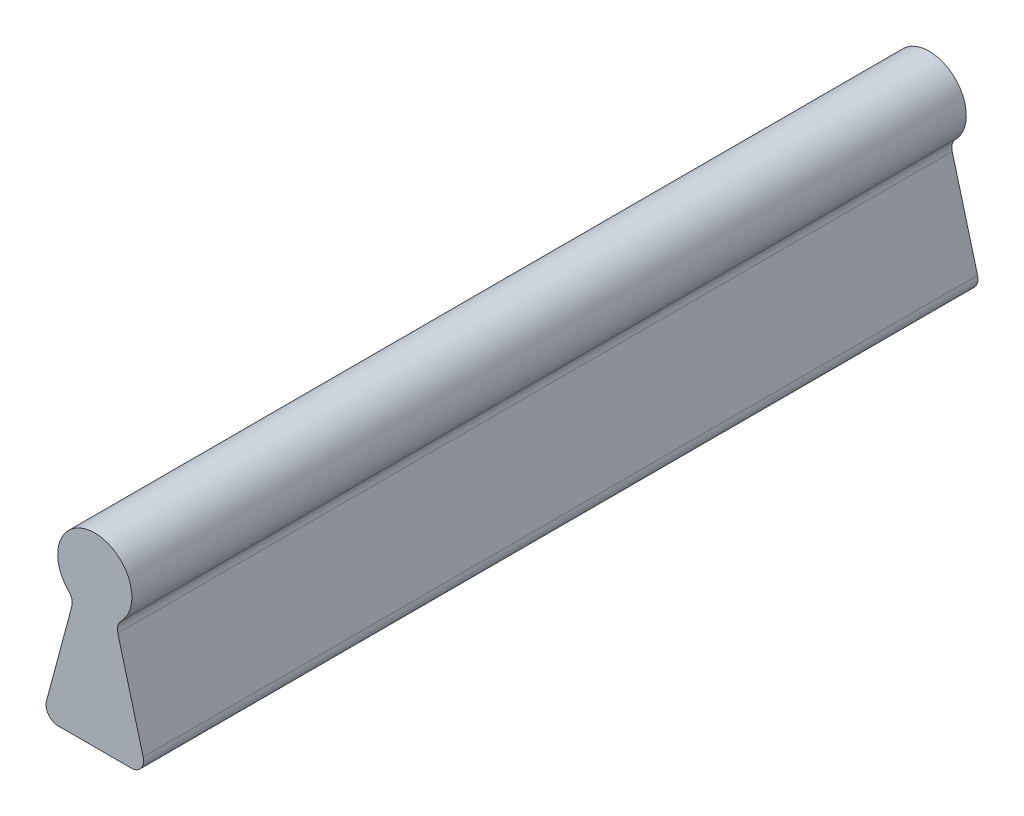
ISO-10303-21;
HEADER;
FILE_DESCRIPTION(('STEP AP214'),'2;1');
FILE_NAME('part.step','',(''),(''),'','','');
FILE_SCHEMA(('AUTOMOTIVE_DESIGN { 1 0 10303 214 1 1 1 1 }'));
ENDSEC;
DATA;
#1=APPLICATION_CONTEXT('core data for automotive mechanical design processes');
#2=APPLICATION_PROTOCOL_DEFINITION('international standard','automotive_design',2000,#1);
#3=PRODUCT_CONTEXT('',#1,'mechanical');
#4=PRODUCT('Part','Part','',(#3));
#5=PRODUCT_RELATED_PRODUCT_CATEGORY('part','',(#4));
#6=PRODUCT_DEFINITION_FORMATION('','',#4);
#7=PRODUCT_DEFINITION_CONTEXT('part definition',#1,'design');
#8=PRODUCT_DEFINITION('design','',#6,#7);
#9=PRODUCT_DEFINITION_SHAPE('','',#8);
#10=(LENGTH_UNIT() NAMED_UNIT(*) SI_UNIT(.MILLI.,.METRE.));
#11=(NAMED_UNIT(*) PLANE_ANGLE_UNIT() SI_UNIT($,.RADIAN.));
#12=(NAMED_UNIT(*) SI_UNIT($,.STERADIAN.) SOLID_ANGLE_UNIT());
#13=UNCERTAINTY_MEASURE_WITH_UNIT(LENGTH_MEASURE(1.E-05),#10,'distance_accuracy_value','');
#14=(GEOMETRIC_REPRESENTATION_CONTEXT(3) GLOBAL_UNCERTAINTY_ASSIGNED_CONTEXT((#13)) GLOBAL_UNIT_ASSIGNED_CONTEXT((#10,
#11,#12)) REPRESENTATION_CONTEXT('',''));
#15=CARTESIAN_POINT('',(0.,0.,0.));
#16=DIRECTION('',(0.,0.,1.));
#17=DIRECTION('',(1.,0.,0.));
#18=AXIS2_PLACEMENT_3D('',#15,#16,#17);
#19=CARTESIAN_POINT('',(24.4474411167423,-6.,84.4507865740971));
#20=DIRECTION('',(0.,0.,-1.));
#21=DIRECTION('',(-1.,0.,0.));
#22=AXIS2_PLACEMENT_3D('',#19,#20,#21);
#23=CYLINDRICAL_SURFACE('',#22,1.);
#24=CARTESIAN_POINT('',(24.4474411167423,-6.,67.5));
#25=DIRECTION('',(0.,0.,1.));
#26=DIRECTION('',(0.,-1.,0.));
#27=AXIS2_PLACEMENT_3D('',#24,#25,#26);
#28=CIRCLE('',#27,1.);
#29=CARTESIAN_POINT('',(24.4474411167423,-7.,67.5));
#30=VERTEX_POINT('',#29);
#31=CARTESIAN_POINT('',(25.4133669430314,-5.74118095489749,67.5));
#32=VERTEX_POINT('',#31);
#33=EDGE_CURVE('E131',#30,#32,#28,.T.);
#34=ORIENTED_EDGE('',*,*,#33,.F.);
#35=DIRECTION('',(0.,0.,-1.));
#36=VECTOR('',#35,1.);
#37=CARTESIAN_POINT('',(24.4474411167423,-7.,84.4507865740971));
#38=LINE('',#37,#36);
#39=CARTESIAN_POINT('',(24.4474411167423,-7.,0.));
#40=VERTEX_POINT('',#39);
#41=EDGE_CURVE('E36',#30,#40,#38,.T.);
#42=ORIENTED_EDGE('',*,*,#41,.T.);
#43=CARTESIAN_POINT('',(24.4474411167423,-6.,0.));
#44=DIRECTION('',(0.,0.,1.));
#45=DIRECTION('',(1.,0.,0.));
#46=AXIS2_PLACEMENT_3D('',#43,#44,#45);
#47=CIRCLE('',#46,1.);
#48=CARTESIAN_POINT('',(25.4133669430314,-5.74118095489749,0.));
#49=VERTEX_POINT('',#48);
#50=EDGE_CURVE('E139',#40,#49,#47,.T.);
#51=ORIENTED_EDGE('',*,*,#50,.T.);
#52=DIRECTION('',(0.,0.,-1.));
#53=VECTOR('',#52,1.);
#54=CARTESIAN_POINT('',(25.4133669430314,-5.74118095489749,84.4507865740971));
#55=LINE('',#54,#53);
#56=EDGE_CURVE('E87',#32,#49,#55,.T.);
#57=ORIENTED_EDGE('',*,*,#56,.F.);
#58=EDGE_LOOP('',(#34,#42,#51,#57));
#59=FACE_BOUND('',#58,.T.);
#60=ADVANCED_FACE('F32',(#59),#23,.T.);
#61=CARTESIAN_POINT('',(25.4133669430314,-5.74118095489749,84.4507865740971));
#62=DIRECTION('',(-0.96592582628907,-0.258819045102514,0.));
#63=DIRECTION('',(0.258819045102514,-0.96592582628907,0.));
#64=AXIS2_PLACEMENT_3D('',#61,#62,#63);
#65=PLANE('',#64);
#66=DIRECTION('',(-0.258819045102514,0.96592582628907,0.));
#67=VECTOR('',#66,1.);
#68=CARTESIAN_POINT('',(25.4133669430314,-5.74118095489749,67.5));
#69=LINE('',#68,#67);
#70=CARTESIAN_POINT('',(23.3625012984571,1.9127538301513,67.5));
#71=VERTEX_POINT('',#70);
#72=EDGE_CURVE('E94',#32,#71,#69,.T.);
#73=ORIENTED_EDGE('',*,*,#72,.F.);
#74=ORIENTED_EDGE('',*,*,#56,.T.);
#75=DIRECTION('',(-0.258819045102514,0.96592582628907,0.));
#76=VECTOR('',#75,1.);
#77=CARTESIAN_POINT('',(25.4133669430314,-5.74118095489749,0.));
#78=LINE('',#77,#76);
#79=CARTESIAN_POINT('',(23.3625012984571,1.9127538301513,0.));
#80=VERTEX_POINT('',#79);
#81=EDGE_CURVE('E138',#49,#80,#78,.T.);
#82=ORIENTED_EDGE('',*,*,#81,.T.);
#83=DIRECTION('',(0.,0.,-1.));
#84=VECTOR('',#83,1.);
#85=CARTESIAN_POINT('',(23.3625012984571,1.9127538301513,84.4507865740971));
#86=LINE('',#85,#84);
#87=EDGE_CURVE('E140',#71,#80,#86,.T.);
#88=ORIENTED_EDGE('',*,*,#87,.F.);
#89=EDGE_LOOP('',(#73,#74,#82,#88));
#90=FACE_BOUND('',#89,.T.);
#91=ADVANCED_FACE('F169',(#90),#65,.F.);
#92=CARTESIAN_POINT('',(24.3284271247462,2.17157287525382,84.4507865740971));
#93=DIRECTION('',(0.,0.,-1.));
#94=DIRECTION('',(-1.,0.,0.));
#95=AXIS2_PLACEMENT_3D('',#92,#93,#94);
#96=CYLINDRICAL_SURFACE('',#95,1.);
#97=CARTESIAN_POINT('',(24.3284271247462,2.17157287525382,67.5));
#98=DIRECTION('',(0.,0.,1.));
#99=DIRECTION('',(0.,-1.,0.));
#100=AXIS2_PLACEMENT_3D('',#97,#98,#99);
#101=CIRCLE('',#100,1.);
#102=CARTESIAN_POINT('',(23.6213203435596,2.87867965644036,67.5));
#103=VERTEX_POINT('',#102);
#104=EDGE_CURVE('E127',#71,#103,#101,.F.);
#105=ORIENTED_EDGE('',*,*,#104,.F.);
#106=ORIENTED_EDGE('',*,*,#87,.T.);
#107=CARTESIAN_POINT('',(24.3284271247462,2.17157287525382,0.));
#108=DIRECTION('',(0.,0.,-1.));
#109=DIRECTION('',(1.,0.,0.));
#110=AXIS2_PLACEMENT_3D('',#107,#108,#109);
#111=CIRCLE('',#110,1.);
#112=CARTESIAN_POINT('',(23.6213203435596,2.87867965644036,0.));
#113=VERTEX_POINT('',#112);
#114=EDGE_CURVE('E142',#80,#113,#111,.T.);
#115=ORIENTED_EDGE('',*,*,#114,.T.);
#116=DIRECTION('',(0.,0.,-1.));
#117=VECTOR('',#116,1.);
#118=CARTESIAN_POINT('',(23.6213203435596,2.87867965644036,84.4507865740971));
#119=LINE('',#118,#117);
#120=EDGE_CURVE('E143',#103,#113,#119,.T.);
#121=ORIENTED_EDGE('',*,*,#120,.F.);
#122=EDGE_LOOP('',(#105,#106,#115,#121));
#123=FACE_BOUND('',#122,.T.);
#124=ADVANCED_FACE('F172',(#123),#96,.F.);
#125=CARTESIAN_POINT('',(21.5,5.,84.4507865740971));
#126=DIRECTION('',(0.,0.,-1.));
#127=DIRECTION('',(-1.,0.,0.));
#128=AXIS2_PLACEMENT_3D('',#125,#126,#127);
#129=CYLINDRICAL_SURFACE('',#128,3.);
#130=CARTESIAN_POINT('',(21.5,5.,67.5));
#131=DIRECTION('',(0.,0.,1.));
#132=DIRECTION('',(0.,-1.,0.));
#133=AXIS2_PLACEMENT_3D('',#130,#131,#132);
#134=CIRCLE('',#133,3.);
#135=CARTESIAN_POINT('',(19.3786796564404,2.87867965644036,67.5));
#136=VERTEX_POINT('',#135);
#137=EDGE_CURVE('E122',#103,#136,#134,.T.);
#138=ORIENTED_EDGE('',*,*,#137,.F.);
#139=ORIENTED_EDGE('',*,*,#120,.T.);
#140=CARTESIAN_POINT('',(21.5,5.,0.));
#141=DIRECTION('',(0.,0.,1.));
#142=DIRECTION('',(1.,0.,0.));
#143=AXIS2_PLACEMENT_3D('',#140,#141,#142);
#144=CIRCLE('',#143,3.);
#145=CARTESIAN_POINT('',(19.3786796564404,2.87867965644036,0.));
#146=VERTEX_POINT('',#145);
#147=EDGE_CURVE('E145',#113,#146,#144,.T.);
#148=ORIENTED_EDGE('',*,*,#147,.T.);
#149=DIRECTION('',(0.,0.,-1.));
#150=VECTOR('',#149,1.);
#151=CARTESIAN_POINT('',(19.3786796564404,2.87867965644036,84.4507865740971));
#152=LINE('',#151,#150);
#153=EDGE_CURVE('E146',#136,#146,#152,.T.);
#154=ORIENTED_EDGE('',*,*,#153,.F.);
#155=EDGE_LOOP('',(#138,#139,#148,#154));
#156=FACE_BOUND('',#155,.T.);
#157=ADVANCED_FACE('F174',(#156),#129,.T.);
#158=CARTESIAN_POINT('',(18.6715728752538,2.17157287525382,84.4507865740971));
#159=DIRECTION('',(0.,0.,-1.));
#160=DIRECTION('',(-1.,0.,0.));
#161=AXIS2_PLACEMENT_3D('',#158,#159,#160);
#162=CYLINDRICAL_SURFACE('',#161,1.);
#163=CARTESIAN_POINT('',(18.6715728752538,2.17157287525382,67.5));
#164=DIRECTION('',(0.,0.,1.));
#165=DIRECTION('',(0.,-1.,0.));
#166=AXIS2_PLACEMENT_3D('',#163,#164,#165);
#167=CIRCLE('',#166,1.);
#168=CARTESIAN_POINT('',(19.6374987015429,1.9127538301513,67.5));
#169=VERTEX_POINT('',#168);
#170=EDGE_CURVE('E120',#136,#169,#167,.F.);
#171=ORIENTED_EDGE('',*,*,#170,.F.);
#172=ORIENTED_EDGE('',*,*,#153,.T.);
#173=CARTESIAN_POINT('',(18.6715728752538,2.17157287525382,0.));
#174=DIRECTION('',(0.,0.,-1.));
#175=DIRECTION('',(1.,0.,0.));
#176=AXIS2_PLACEMENT_3D('',#173,#174,#175);
#177=CIRCLE('',#176,1.);
#178=CARTESIAN_POINT('',(19.6374987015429,1.9127538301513,0.));
#179=VERTEX_POINT('',#178);
#180=EDGE_CURVE('E148',#146,#179,#177,.T.);
#181=ORIENTED_EDGE('',*,*,#180,.T.);
#182=DIRECTION('',(0.,0.,-1.));
#183=VECTOR('',#182,1.);
#184=CARTESIAN_POINT('',(19.6374987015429,1.9127538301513,84.4507865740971));
#185=LINE('',#184,#183);
#186=EDGE_CURVE('E149',#169,#179,#185,.T.);
#187=ORIENTED_EDGE('',*,*,#186,.F.);
#188=EDGE_LOOP('',(#171,#172,#181,#187));
#189=FACE_BOUND('',#188,.T.);
#190=ADVANCED_FACE('F178',(#189),#162,.F.);
#191=CARTESIAN_POINT('',(19.6374987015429,1.9127538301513,84.4507865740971));
#192=DIRECTION('',(0.96592582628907,-0.258819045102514,0.));
#193=DIRECTION('',(0.258819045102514,0.96592582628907,0.));
#194=AXIS2_PLACEMENT_3D('',#191,#192,#193);
#195=PLANE('',#194);
#196=DIRECTION('',(-0.258819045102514,-0.96592582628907,0.));
#197=VECTOR('',#196,1.);
#198=CARTESIAN_POINT('',(19.6374987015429,1.9127538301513,67.5));
#199=LINE('',#198,#197);
#200=CARTESIAN_POINT('',(17.5866330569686,-5.74118095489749,67.5));
#201=VERTEX_POINT('',#200);
#202=EDGE_CURVE('E41',#169,#201,#199,.T.);
#203=ORIENTED_EDGE('',*,*,#202,.F.);
#204=ORIENTED_EDGE('',*,*,#186,.T.);
#205=DIRECTION('',(-0.258819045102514,-0.96592582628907,0.));
#206=VECTOR('',#205,1.);
#207=CARTESIAN_POINT('',(19.6374987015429,1.9127538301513,0.));
#208=LINE('',#207,#206);
#209=CARTESIAN_POINT('',(17.5866330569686,-5.74118095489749,0.));
#210=VERTEX_POINT('',#209);
#211=EDGE_CURVE('E114',#179,#210,#208,.T.);
#212=ORIENTED_EDGE('',*,*,#211,.T.);
#213=DIRECTION('',(0.,0.,-1.));
#214=VECTOR('',#213,1.);
#215=CARTESIAN_POINT('',(17.5866330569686,-5.74118095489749,84.4507865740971));
#216=LINE('',#215,#214);
#217=EDGE_CURVE('E105',#201,#210,#216,.T.);
#218=ORIENTED_EDGE('',*,*,#217,.F.);
#219=EDGE_LOOP('',(#203,#204,#212,#218));
#220=FACE_BOUND('',#219,.T.);
#221=ADVANCED_FACE('F111',(#220),#195,.F.);
#222=CARTESIAN_POINT('',(18.5525588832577,-6.,84.4507865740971));
#223=DIRECTION('',(0.,0.,-1.));
#224=DIRECTION('',(-1.,0.,0.));
#225=AXIS2_PLACEMENT_3D('',#222,#223,#224);
#226=CYLINDRICAL_SURFACE('',#225,1.);
#227=CARTESIAN_POINT('',(18.5525588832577,-6.,67.5));
#228=DIRECTION('',(0.,0.,1.));
#229=DIRECTION('',(0.,-1.,0.));
#230=AXIS2_PLACEMENT_3D('',#227,#228,#229);
#231=CIRCLE('',#230,1.);
#232=CARTESIAN_POINT('',(18.5525588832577,-7.,67.5));
#233=VERTEX_POINT('',#232);
#234=EDGE_CURVE('E11',#201,#233,#231,.T.);
#235=ORIENTED_EDGE('',*,*,#234,.F.);
#236=ORIENTED_EDGE('',*,*,#217,.T.);
#237=CARTESIAN_POINT('',(18.5525588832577,-6.,0.));
#238=DIRECTION('',(0.,0.,1.));
#239=DIRECTION('',(1.,0.,0.));
#240=AXIS2_PLACEMENT_3D('',#237,#238,#239);
#241=CIRCLE('',#240,1.);
#242=CARTESIAN_POINT('',(18.5525588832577,-7.,0.));
#243=VERTEX_POINT('',#242);
#244=EDGE_CURVE('E116',#210,#243,#241,.T.);
#245=ORIENTED_EDGE('',*,*,#244,.T.);
#246=DIRECTION('',(0.,0.,-1.));
#247=VECTOR('',#246,1.);
#248=CARTESIAN_POINT('',(18.5525588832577,-7.,84.4507865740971));
#249=LINE('',#248,#247);
#250=EDGE_CURVE('E54',#233,#243,#249,.T.);
#251=ORIENTED_EDGE('',*,*,#250,.F.);
#252=EDGE_LOOP('',(#235,#236,#245,#251));
#253=FACE_BOUND('',#252,.T.);
#254=ADVANCED_FACE('F104',(#253),#226,.T.);
#255=CARTESIAN_POINT('',(18.5525588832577,-7.,84.4507865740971));
#256=DIRECTION('',(0.,1.,0.));
#257=DIRECTION('',(-1.,0.,0.));
#258=AXIS2_PLACEMENT_3D('',#255,#256,#257);
#259=PLANE('',#258);
#260=DIRECTION('',(1.,0.,0.));
#261=VECTOR('',#260,1.);
#262=CARTESIAN_POINT('',(18.5525588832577,-7.,67.5));
#263=LINE('',#262,#261);
#264=EDGE_CURVE('E134',#233,#30,#263,.T.);
#265=ORIENTED_EDGE('',*,*,#264,.F.);
#266=ORIENTED_EDGE('',*,*,#250,.T.);
#267=DIRECTION('',(1.,0.,0.));
#268=VECTOR('',#267,1.);
#269=CARTESIAN_POINT('',(18.5525588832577,-7.,0.));
#270=LINE('',#269,#268);
#271=EDGE_CURVE('E136',#243,#40,#270,.T.);
#272=ORIENTED_EDGE('',*,*,#271,.T.);
#273=ORIENTED_EDGE('',*,*,#41,.F.);
#274=EDGE_LOOP('',(#265,#266,#272,#273));
#275=FACE_BOUND('',#274,.T.);
#276=ADVANCED_FACE('F164',(#275),#259,.F.);
#277=CARTESIAN_POINT('',(24.4474411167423,-6.,0.));
#278=DIRECTION('',(0.,0.,1.));
#279=DIRECTION('',(1.,0.,0.));
#280=AXIS2_PLACEMENT_3D('',#277,#278,#279);
#281=PLANE('',#280);
#282=ORIENTED_EDGE('',*,*,#50,.F.);
#283=ORIENTED_EDGE('',*,*,#271,.F.);
#284=ORIENTED_EDGE('',*,*,#244,.F.);
#285=ORIENTED_EDGE('',*,*,#211,.F.);
#286=ORIENTED_EDGE('',*,*,#180,.F.);
#287=ORIENTED_EDGE('',*,*,#147,.F.);
#288=ORIENTED_EDGE('',*,*,#114,.F.);
#289=ORIENTED_EDGE('',*,*,#81,.F.);
#290=EDGE_LOOP('',(#282,#283,#284,#285,#286,#287,#288,#289));
#291=FACE_BOUND('',#290,.T.);
#292=ADVANCED_FACE('F166',(#291),#281,.F.);
#293=CARTESIAN_POINT('',(25.2999999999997,-0.0499999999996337,67.5));
#294=DIRECTION('',(0.,0.,1.));
#295=DIRECTION('',(0.,-1.,0.));
#296=AXIS2_PLACEMENT_3D('',#293,#294,#295);
#297=PLANE('',#296);
#298=ORIENTED_EDGE('',*,*,#264,.T.);
#299=ORIENTED_EDGE('',*,*,#33,.T.);
#300=ORIENTED_EDGE('',*,*,#72,.T.);
#301=ORIENTED_EDGE('',*,*,#104,.T.);
#302=ORIENTED_EDGE('',*,*,#137,.T.);
#303=ORIENTED_EDGE('',*,*,#170,.T.);
#304=ORIENTED_EDGE('',*,*,#202,.T.);
#305=ORIENTED_EDGE('',*,*,#234,.T.);
#306=EDGE_LOOP('',(#298,#299,#300,#301,#302,#303,#304,#305));
#307=FACE_BOUND('',#306,.T.);
#308=ADVANCED_FACE('F34',(#307),#297,.T.);
#309=CLOSED_SHELL('',(#60,#91,#124,#157,#190,#221,#254,#276,#292,#308));
#310=MANIFOLD_SOLID_BREP('B2',#309);
#311=ADVANCED_BREP_SHAPE_REPRESENTATION('',(#18,#310),#14);
#312=SHAPE_DEFINITION_REPRESENTATION(#9,#311);
ENDSEC;
END-ISO-10303-21;
